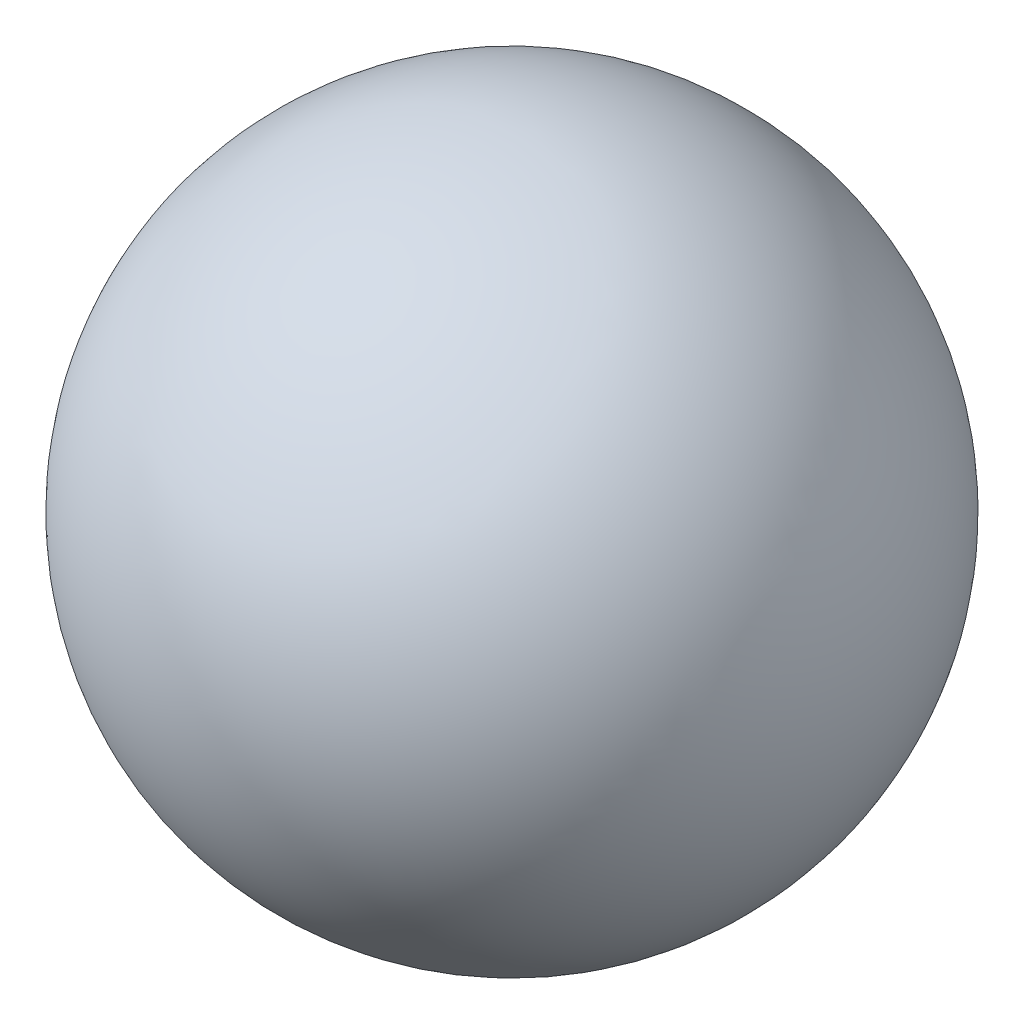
from build123d import *


with BuildPart() as part:
    # Sketch4 → Revolve6 (revolve)
    with BuildSketch(Plane.XY):
        with BuildLine():
            Line((0, 0), (25.4, 0))
            ThreePointArc((25.4, 0), (12.7, -12.7), (0, 0))
        make_face()
    revolve(axis=Axis((0, 0, 0), (1, 0, 0)))


solid = part.part
